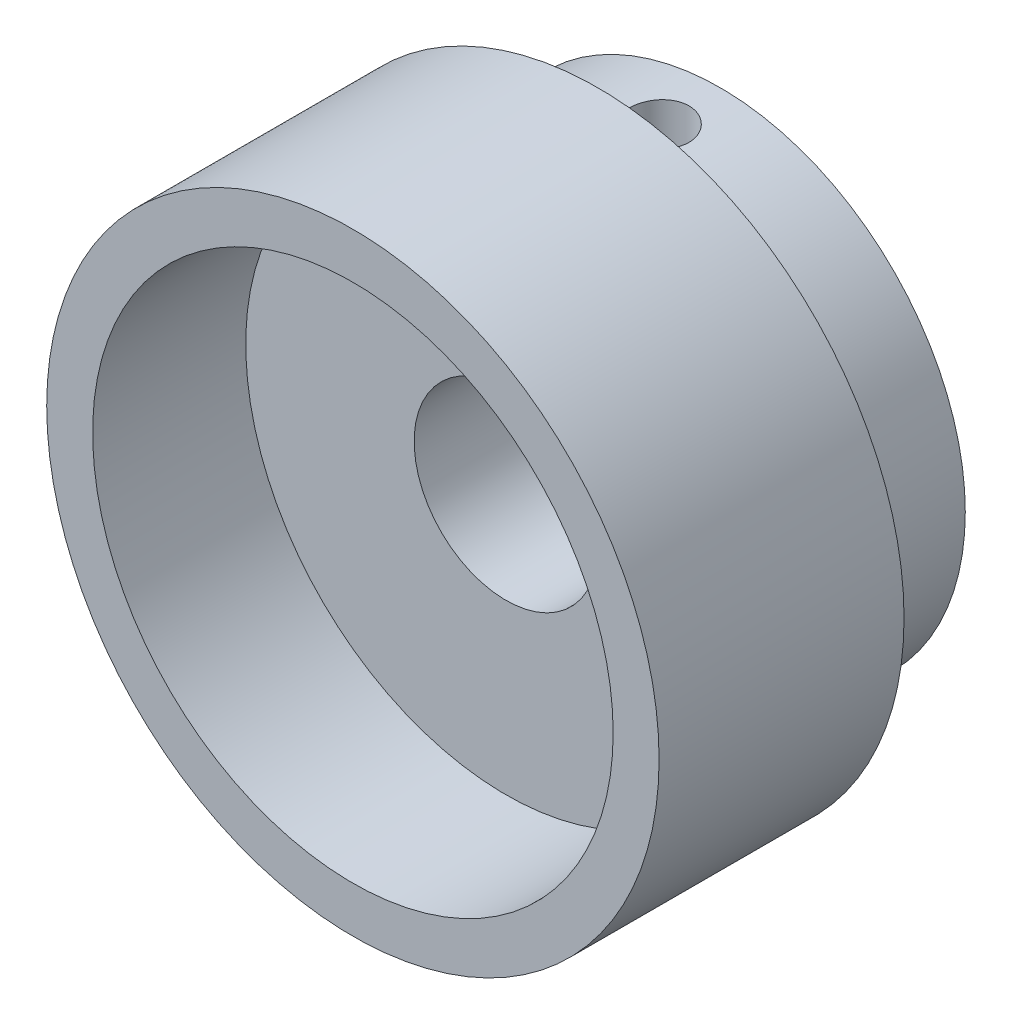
ISO-10303-21;
HEADER;
FILE_DESCRIPTION(('STEP AP214'),'2;1');
FILE_NAME('part.step','',(''),(''),'','','');
FILE_SCHEMA(('AUTOMOTIVE_DESIGN { 1 0 10303 214 1 1 1 1 }'));
ENDSEC;
DATA;
#1=APPLICATION_CONTEXT('core data for automotive mechanical design processes');
#2=APPLICATION_PROTOCOL_DEFINITION('international standard','automotive_design',2000,#1);
#3=PRODUCT_CONTEXT('',#1,'mechanical');
#4=PRODUCT('Part','Part','',(#3));
#5=PRODUCT_RELATED_PRODUCT_CATEGORY('part','',(#4));
#6=PRODUCT_DEFINITION_FORMATION('','',#4);
#7=PRODUCT_DEFINITION_CONTEXT('part definition',#1,'design');
#8=PRODUCT_DEFINITION('design','',#6,#7);
#9=PRODUCT_DEFINITION_SHAPE('','',#8);
#10=(LENGTH_UNIT() NAMED_UNIT(*) SI_UNIT(.MILLI.,.METRE.));
#11=(NAMED_UNIT(*) PLANE_ANGLE_UNIT() SI_UNIT($,.RADIAN.));
#12=(NAMED_UNIT(*) SI_UNIT($,.STERADIAN.) SOLID_ANGLE_UNIT());
#13=UNCERTAINTY_MEASURE_WITH_UNIT(LENGTH_MEASURE(1.E-05),#10,'distance_accuracy_value','');
#14=(GEOMETRIC_REPRESENTATION_CONTEXT(3) GLOBAL_UNCERTAINTY_ASSIGNED_CONTEXT((#13)) GLOBAL_UNIT_ASSIGNED_CONTEXT((#10,
#11,#12)) REPRESENTATION_CONTEXT('',''));
#15=CARTESIAN_POINT('',(0.,0.,0.));
#16=DIRECTION('',(0.,0.,1.));
#17=DIRECTION('',(1.,0.,0.));
#18=AXIS2_PLACEMENT_3D('',#15,#16,#17);
#19=CARTESIAN_POINT('',(0.,0.,20.));
#20=DIRECTION('',(0.,0.,1.));
#21=DIRECTION('',(1.,0.,0.));
#22=AXIS2_PLACEMENT_3D('',#19,#20,#21);
#23=CYLINDRICAL_SURFACE('',#22,6.);
#24=CARTESIAN_POINT('',(0.,0.,0.));
#25=DIRECTION('',(0.,0.,1.));
#26=DIRECTION('',(1.,0.,0.));
#27=AXIS2_PLACEMENT_3D('',#24,#25,#26);
#28=CIRCLE('',#27,6.);
#29=CARTESIAN_POINT('',(6.,0.,0.));
#30=VERTEX_POINT('',#29);
#31=EDGE_CURVE('E8',#30,#30,#28,.T.);
#32=ORIENTED_EDGE('',*,*,#31,.F.);
#33=EDGE_LOOP('',(#32));
#34=FACE_BOUND('',#33,.T.);
#35=CARTESIAN_POINT('',(0.,0.,14.));
#36=DIRECTION('',(0.,0.,1.));
#37=DIRECTION('',(1.,0.,0.));
#38=AXIS2_PLACEMENT_3D('',#35,#36,#37);
#39=CIRCLE('',#38,6.);
#40=CARTESIAN_POINT('',(6.,0.,14.));
#41=VERTEX_POINT('',#40);
#42=EDGE_CURVE('E25',#41,#41,#39,.T.);
#43=ORIENTED_EDGE('',*,*,#42,.T.);
#44=EDGE_LOOP('',(#43));
#45=FACE_BOUND('',#44,.T.);
#46=CARTESIAN_POINT('',(0.,6.,2.05));
#47=CARTESIAN_POINT('',(-0.10654762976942,5.99999993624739,2.05000001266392));
#48=CARTESIAN_POINT('',(-0.213096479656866,5.99713547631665,2.05876117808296));
#49=CARTESIAN_POINT('',(-0.423064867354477,5.98599010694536,2.09347340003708));
#50=CARTESIAN_POINT('',(-0.526483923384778,5.97770836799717,2.1194270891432));
#51=CARTESIAN_POINT('',(-0.72713509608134,5.95663029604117,2.18754713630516));
#52=CARTESIAN_POINT('',(-0.824376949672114,5.94384128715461,2.22968720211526));
#53=CARTESIAN_POINT('',(-1.0104135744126,5.91506016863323,2.32886779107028));
#54=CARTESIAN_POINT('',(-1.09920680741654,5.89906747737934,2.38591102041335));
#55=CARTESIAN_POINT('',(-1.26876648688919,5.86497559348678,2.51526463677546));
#56=CARTESIAN_POINT('',(-1.34921422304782,5.84682777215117,2.58797991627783));
#57=CARTESIAN_POINT('',(-1.49701406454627,5.81074421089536,2.74575217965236));
#58=CARTESIAN_POINT('',(-1.56436347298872,5.79280851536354,2.83081169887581));
#59=CARTESIAN_POINT('',(-1.68583680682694,5.75865033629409,3.01368221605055));
#60=CARTESIAN_POINT('',(-1.73955302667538,5.74248742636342,3.11177622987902));
#61=CARTESIAN_POINT('',(-1.8295913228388,5.71444098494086,3.31621594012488));
#62=CARTESIAN_POINT('',(-1.86591840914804,5.70255622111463,3.42255924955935));
#63=CARTESIAN_POINT('',(-1.91896356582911,5.68492237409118,3.63686559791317));
#64=CARTESIAN_POINT('',(-1.93627644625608,5.67898771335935,3.74466569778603));
#65=CARTESIAN_POINT('',(-1.9526607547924,5.67337624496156,3.96179137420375));
#66=CARTESIAN_POINT('',(-1.95173749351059,5.67369761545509,4.07111649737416));
#67=CARTESIAN_POINT('',(-1.93213893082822,5.68039878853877,4.28317904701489));
#68=CARTESIAN_POINT('',(-1.91423155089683,5.68651650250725,4.38599714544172));
#69=CARTESIAN_POINT('',(-1.86242269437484,5.70369344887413,4.58708184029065));
#70=CARTESIAN_POINT('',(-1.8285193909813,5.71475324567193,4.6853479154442));
#71=CARTESIAN_POINT('',(-1.74516242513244,5.7407606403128,4.87631816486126));
#72=CARTESIAN_POINT('',(-1.69547573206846,5.75576587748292,4.96891243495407));
#73=CARTESIAN_POINT('',(-1.58212419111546,5.78794837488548,5.14469555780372));
#74=CARTESIAN_POINT('',(-1.51845546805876,5.80512623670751,5.227881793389));
#75=CARTESIAN_POINT('',(-1.37522643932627,5.84075786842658,5.38681348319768));
#76=CARTESIAN_POINT('',(-1.29503579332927,5.85923271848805,5.46198726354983));
#77=CARTESIAN_POINT('',(-1.12295756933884,5.89463082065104,5.59796503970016));
#78=CARTESIAN_POINT('',(-1.03106897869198,5.91155393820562,5.65876779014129));
#79=CARTESIAN_POINT('',(-0.837035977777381,5.94214524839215,5.76470774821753));
#80=CARTESIAN_POINT('',(-0.734806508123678,5.95578269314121,5.80969865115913));
#81=CARTESIAN_POINT('',(-0.523682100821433,5.9780434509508,5.88167052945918));
#82=CARTESIAN_POINT('',(-0.414789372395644,5.98666841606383,5.90865743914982));
#83=CARTESIAN_POINT('',(-0.198274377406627,5.99766191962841,5.94285838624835));
#84=CARTESIAN_POINT('',(-0.0907864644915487,6.00027491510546,5.95084547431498));
#85=CARTESIAN_POINT('',(0.124010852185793,5.999679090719,5.94901300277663));
#86=CARTESIAN_POINT('',(0.231320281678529,5.99647119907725,5.93919628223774));
#87=CARTESIAN_POINT('',(0.439666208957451,5.98475514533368,5.90265032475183));
#88=CARTESIAN_POINT('',(0.540793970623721,5.97639393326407,5.8763896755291));
#89=CARTESIAN_POINT('',(0.737172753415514,5.95536205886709,5.80828141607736));
#90=CARTESIAN_POINT('',(0.832423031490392,5.9426908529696,5.76643183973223));
#91=CARTESIAN_POINT('',(1.01705433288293,5.91392921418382,5.6671436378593));
#92=CARTESIAN_POINT('',(1.10622311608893,5.89775966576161,5.60933390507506));
#93=CARTESIAN_POINT('',(1.27384890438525,5.86384129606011,5.48020605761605));
#94=CARTESIAN_POINT('',(1.35230277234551,5.84609201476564,5.4088840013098));
#95=CARTESIAN_POINT('',(1.49978458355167,5.81004836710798,5.25111941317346));
#96=CARTESIAN_POINT('',(1.5682610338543,5.79176344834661,5.16415795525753));
#97=CARTESIAN_POINT('',(1.6897096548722,5.75750609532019,4.97958339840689));
#98=CARTESIAN_POINT('',(1.74268186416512,5.74153365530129,4.88197032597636));
#99=CARTESIAN_POINT('',(1.83133479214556,5.71387576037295,4.67892847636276));
#100=CARTESIAN_POINT('',(1.86706477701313,5.70217811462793,4.57352297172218));
#101=CARTESIAN_POINT('',(1.92012057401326,5.68453462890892,4.35772733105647));
#102=CARTESIAN_POINT('',(1.93745414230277,5.67858636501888,4.24733931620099));
#103=CARTESIAN_POINT('',(1.95263912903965,5.67338152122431,4.03051592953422));
#104=CARTESIAN_POINT('',(1.95140148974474,5.6738120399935,3.92415112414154));
#105=CARTESIAN_POINT('',(1.93170368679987,5.68054809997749,3.71322760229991));
#106=CARTESIAN_POINT('',(1.91324445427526,5.68685332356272,3.60866878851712));
#107=CARTESIAN_POINT('',(1.8602584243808,5.70440107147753,3.40610073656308));
#108=CARTESIAN_POINT('',(1.82601260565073,5.71555706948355,3.30800992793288));
#109=CARTESIAN_POINT('',(1.74265033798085,5.74152130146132,3.11888969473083));
#110=CARTESIAN_POINT('',(1.69353069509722,5.75633031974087,3.02786179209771));
#111=CARTESIAN_POINT('',(1.57941527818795,5.78870453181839,2.85132628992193));
#112=CARTESIAN_POINT('',(1.51384134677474,5.80635910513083,2.76620888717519));
#113=CARTESIAN_POINT('',(1.36967230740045,5.84204632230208,2.6078914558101));
#114=CARTESIAN_POINT('',(1.29107360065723,5.86007906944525,2.53469473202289));
#115=CARTESIAN_POINT('',(1.11965252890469,5.89527751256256,2.3996219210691));
#116=CARTESIAN_POINT('',(1.02641699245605,5.91238786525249,2.33825404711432));
#117=CARTESIAN_POINT('',(0.830400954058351,5.94308458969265,2.23213560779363));
#118=CARTESIAN_POINT('',(0.727623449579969,5.95667206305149,2.18737984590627));
#119=CARTESIAN_POINT('',(0.521899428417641,5.97809793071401,2.11820017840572));
#120=CARTESIAN_POINT('',(0.41934480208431,5.98623618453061,2.09270356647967));
#121=CARTESIAN_POINT('',(0.211193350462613,5.99718660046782,2.05860553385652));
#122=CARTESIAN_POINT('',(0.105597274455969,6.00000006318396,2.04999998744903));
#123=CARTESIAN_POINT('',(0.,6.,2.05));
#124=B_SPLINE_CURVE_WITH_KNOTS('',3,(#46,#47,#48,#49,#50,#51,#52,#53,#54,#55,#56,#57,#58,#59,
#60,#61,#62,#63,#64,#65,#66,#67,#68,#69,#70,#71,#72,#73,#74,#75,#76,#77,#78,#79,#80,#81,#82,#83,
#84,#85,#86,#87,#88,#89,#90,#91,#92,#93,#94,#95,#96,#97,#98,#99,#100,#101,#102,#103,#104,#105,
#106,#107,#108,#109,#110,#111,#112,#113,#114,#115,#116,#117,#118,#119,#120,#121,#122,#123),
.UNSPECIFIED.,.T.,.F.,(4,2,2,2,2,2,2,2,2,2,2,2,2,2,2,2,2,2,2,2,2,2,2,2,2,2,2,2,2,2,2,2,2,2,2,2,
2,2,4),(0.,0.319254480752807,0.638557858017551,0.957344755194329,1.27618957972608,
1.60455177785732,1.93298151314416,2.2703084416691,2.60753812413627,2.93388820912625,
3.26014325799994,3.57231670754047,3.88452581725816,4.20157729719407,4.51871676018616,
4.85154507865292,5.18440222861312,5.52026283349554,5.85601267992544,6.17784892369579,
6.49963385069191,6.81264216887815,7.12568997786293,7.446739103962,7.76788202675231,
8.10285626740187,8.43782967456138,8.77184021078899,9.10570986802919,9.42325867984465,
9.74079032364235,10.0528764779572,10.3650296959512,10.6902404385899,11.0155411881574,
11.3526664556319,11.6896861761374,12.0061703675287,12.3225772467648),.UNSPECIFIED.);
#125=CARTESIAN_POINT('',(0.,6.,2.05));
#126=VERTEX_POINT('',#125);
#127=EDGE_CURVE('E49',#126,#126,#124,.T.);
#128=ORIENTED_EDGE('',*,*,#127,.T.);
#129=EDGE_LOOP('',(#128));
#130=FACE_BOUND('',#129,.T.);
#131=ADVANCED_FACE('F12',(#34,#45,#130),#23,.F.);
#132=CARTESIAN_POINT('',(0.,0.,20.));
#133=DIRECTION('',(0.,0.,1.));
#134=DIRECTION('',(1.,0.,0.));
#135=AXIS2_PLACEMENT_3D('',#132,#133,#134);
#136=CYLINDRICAL_SURFACE('',#135,16.);
#137=CARTESIAN_POINT('',(0.,0.,0.));
#138=DIRECTION('',(0.,0.,1.));
#139=DIRECTION('',(1.,0.,0.));
#140=AXIS2_PLACEMENT_3D('',#137,#138,#139);
#141=CIRCLE('',#140,16.);
#142=CARTESIAN_POINT('',(16.,0.,0.));
#143=VERTEX_POINT('',#142);
#144=EDGE_CURVE('E46',#143,#143,#141,.T.);
#145=ORIENTED_EDGE('',*,*,#144,.T.);
#146=EDGE_LOOP('',(#145));
#147=FACE_BOUND('',#146,.T.);
#148=CARTESIAN_POINT('',(0.,0.,8.));
#149=DIRECTION('',(0.,0.,1.));
#150=DIRECTION('',(1.,0.,0.));
#151=AXIS2_PLACEMENT_3D('',#148,#149,#150);
#152=CIRCLE('',#151,16.);
#153=CARTESIAN_POINT('',(16.,0.,8.));
#154=VERTEX_POINT('',#153);
#155=EDGE_CURVE('E43',#154,#154,#152,.T.);
#156=ORIENTED_EDGE('',*,*,#155,.F.);
#157=EDGE_LOOP('',(#156));
#158=FACE_BOUND('',#157,.T.);
#159=CARTESIAN_POINT('',(0.,16.,2.05));
#160=CARTESIAN_POINT('',(-0.109098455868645,15.9999985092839,2.05000464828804));
#161=CARTESIAN_POINT('',(-0.218265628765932,15.9988723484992,2.05918661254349));
#162=CARTESIAN_POINT('',(-0.433563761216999,15.9944881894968,2.09567119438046));
#163=CARTESIAN_POINT('',(-0.539691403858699,15.9912279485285,2.12299287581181));
#164=CARTESIAN_POINT('',(-0.745762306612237,15.9829430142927,2.194941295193));
#165=CARTESIAN_POINT('',(-0.845709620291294,15.9779194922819,2.23955654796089));
#166=CARTESIAN_POINT('',(-1.03667874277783,15.9666671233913,2.34480089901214));
#167=CARTESIAN_POINT('',(-1.12770211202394,15.9604384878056,2.4054271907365));
#168=CARTESIAN_POINT('',(-1.29873629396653,15.9474351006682,2.54131276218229));
#169=CARTESIAN_POINT('',(-1.37869357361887,15.940657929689,2.61663919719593));
#170=CARTESIAN_POINT('',(-1.52486495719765,15.927340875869,2.77964271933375));
#171=CARTESIAN_POINT('',(-1.59107836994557,15.9208010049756,2.86732042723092));
#172=CARTESIAN_POINT('',(-1.70808066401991,15.908675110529,3.05288396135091));
#173=CARTESIAN_POINT('',(-1.75881960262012,15.9030922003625,3.15080149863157));
#174=CARTESIAN_POINT('',(-1.84311372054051,15.893544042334,3.3538469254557));
#175=CARTESIAN_POINT('',(-1.87666952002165,15.8895787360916,3.45897455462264));
#176=CARTESIAN_POINT('',(-1.9254826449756,15.8837377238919,3.67290148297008));
#177=CARTESIAN_POINT('',(-1.94083017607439,15.881851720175,3.78167991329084));
#178=CARTESIAN_POINT('',(-1.95307019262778,15.8803512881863,4.00028357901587));
#179=CARTESIAN_POINT('',(-1.94996338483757,15.8807367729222,4.11010877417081));
#180=CARTESIAN_POINT('',(-1.92545700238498,15.8837263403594,4.32706071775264));
#181=CARTESIAN_POINT('',(-1.90415667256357,15.8863183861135,4.43419886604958));
#182=CARTESIAN_POINT('',(-1.84402267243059,15.8934102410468,4.64336857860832));
#183=CARTESIAN_POINT('',(-1.80518866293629,15.8979100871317,4.74540004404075));
#184=CARTESIAN_POINT('',(-1.71098259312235,15.9083242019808,4.94176911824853));
#185=CARTESIAN_POINT('',(-1.65556728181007,15.9142421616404,5.03608577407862));
#186=CARTESIAN_POINT('',(-1.52980260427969,15.9268228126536,5.21411836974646));
#187=CARTESIAN_POINT('',(-1.45945258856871,15.9334855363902,5.29783384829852));
#188=CARTESIAN_POINT('',(-1.30526487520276,15.9468585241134,5.45286385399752));
#189=CARTESIAN_POINT('',(-1.22134161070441,15.9535688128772,5.52409330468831));
#190=CARTESIAN_POINT('',(-1.04268463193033,15.966239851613,5.65146730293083));
#191=CARTESIAN_POINT('',(-0.947950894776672,15.9722005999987,5.70761181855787));
#192=CARTESIAN_POINT('',(-0.750297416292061,15.9827043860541,5.80322179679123));
#193=CARTESIAN_POINT('',(-0.647375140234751,15.9872469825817,5.84268207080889));
#194=CARTESIAN_POINT('',(-0.436297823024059,15.9943985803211,5.90373660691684));
#195=CARTESIAN_POINT('',(-0.328143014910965,15.9970076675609,5.92533166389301));
#196=CARTESIAN_POINT('',(-0.110406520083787,15.9999871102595,5.94993281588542));
#197=CARTESIAN_POINT('',(-0.000838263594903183,16.0003715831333,5.95305613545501));
#198=CARTESIAN_POINT('',(0.21726011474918,15.9988965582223,5.94093430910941));
#199=CARTESIAN_POINT('',(0.32579025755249,15.9970371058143,5.92568953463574));
#200=CARTESIAN_POINT('',(0.538386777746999,15.9912919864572,5.87736163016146));
#201=CARTESIAN_POINT('',(0.642466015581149,15.987412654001,5.84433425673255));
#202=CARTESIAN_POINT('',(0.843608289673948,15.9780622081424,5.76143655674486));
#203=CARTESIAN_POINT('',(0.940671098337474,15.9725910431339,5.71156568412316));
#204=CARTESIAN_POINT('',(1.125549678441,15.9606319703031,5.59611204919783));
#205=CARTESIAN_POINT('',(1.21331767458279,15.9541391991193,5.53045329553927));
#206=CARTESIAN_POINT('',(1.37662948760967,15.9408788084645,5.3853954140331));
#207=CARTESIAN_POINT('',(1.45217284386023,15.9341111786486,5.30599576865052));
#208=CARTESIAN_POINT('',(1.58930567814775,15.9210204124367,5.13519425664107));
#209=CARTESIAN_POINT('',(1.65081755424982,15.9146998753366,5.04372985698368));
#210=CARTESIAN_POINT('',(1.7576055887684,15.9032612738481,4.85169929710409));
#211=CARTESIAN_POINT('',(1.80288205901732,15.8981431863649,4.75113331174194));
#212=CARTESIAN_POINT('',(1.87578782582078,15.8897065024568,4.54400681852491));
#213=CARTESIAN_POINT('',(1.90346120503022,15.88638341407,4.43746201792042));
#214=CARTESIAN_POINT('',(1.94051736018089,15.8818999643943,4.22119478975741));
#215=CARTESIAN_POINT('',(1.94990094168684,15.8807395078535,4.11147250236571));
#216=CARTESIAN_POINT('',(1.9500968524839,15.8807153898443,3.8927368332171));
#217=CARTESIAN_POINT('',(1.94103109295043,15.8818366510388,3.7837235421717));
#218=CARTESIAN_POINT('',(1.90484347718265,15.8862172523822,3.56878221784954));
#219=CARTESIAN_POINT('',(1.87772161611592,15.8894765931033,3.46285418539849));
#220=CARTESIAN_POINT('',(1.80622921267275,15.8977615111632,3.25710429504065));
#221=CARTESIAN_POINT('',(1.76186423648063,15.9027865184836,3.15728047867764));
#222=CARTESIAN_POINT('',(1.65715699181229,15.914037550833,2.9664749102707));
#223=CARTESIAN_POINT('',(1.59681456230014,15.9202635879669,2.87549324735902));
#224=CARTESIAN_POINT('',(1.46141210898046,15.9332644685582,2.70433111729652));
#225=CARTESIAN_POINT('',(1.38626119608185,15.9400425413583,2.62422279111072));
#226=CARTESIAN_POINT('',(1.2235638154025,15.953355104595,2.47770657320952));
#227=CARTESIAN_POINT('',(1.1360144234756,15.9598895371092,2.41130192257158));
#228=CARTESIAN_POINT('',(0.950643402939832,15.9720045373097,2.29387497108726));
#229=CARTESIAN_POINT('',(0.852785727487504,15.9775815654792,2.24290923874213));
#230=CARTESIAN_POINT('',(0.649888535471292,15.9871172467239,2.15820619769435));
#231=CARTESIAN_POINT('',(0.54485700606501,15.9910776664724,2.12445007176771));
#232=CARTESIAN_POINT('',(0.366062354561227,15.9959736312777,2.08325102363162));
#233=CARTESIAN_POINT('',(0.293428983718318,15.9974762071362,2.07079968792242));
#234=CARTESIAN_POINT('',(0.147207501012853,15.9994898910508,2.05417263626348));
#235=CARTESIAN_POINT('',(0.073619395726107,16.0000010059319,2.04999686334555));
#236=CARTESIAN_POINT('',(0.,16.,2.05));
#237=B_SPLINE_CURVE_WITH_KNOTS('',3,(#159,#160,#161,#162,#163,#164,#165,#166,#167,#168,#169,
#170,#171,#172,#173,#174,#175,#176,#177,#178,#179,#180,#181,#182,#183,#184,#185,#186,#187,#188,
#189,#190,#191,#192,#193,#194,#195,#196,#197,#198,#199,#200,#201,#202,#203,#204,#205,#206,#207,
#208,#209,#210,#211,#212,#213,#214,#215,#216,#217,#218,#219,#220,#221,#222,#223,#224,#225,#226,
#227,#228,#229,#230,#231,#232,#233,#234,#235,#236),.UNSPECIFIED.,.T.,.F.,(4,2,2,2,2,2,2,2,2,2,2,
2,2,2,2,2,2,2,2,2,2,2,2,2,2,2,2,2,2,2,2,2,2,2,2,2,2,2,4),(0.,0.327026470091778,0.65439717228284,
0.981550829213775,1.30864717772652,1.63727435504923,1.96591805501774,2.29561146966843,
2.6252929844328,2.95333431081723,3.28136307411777,3.60761380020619,3.93387083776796,
4.26098642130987,4.58811623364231,4.91739501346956,5.24667449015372,5.57605629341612,
5.90542344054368,6.23269810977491,6.55996616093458,6.88621400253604,7.21247242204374,
7.54033380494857,7.86820753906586,8.19785286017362,8.52749184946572,8.85630205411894,
9.18509777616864,9.51172790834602,9.8383581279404,10.1648829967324,10.4914111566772,
10.8200096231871,11.1486857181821,11.4785519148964,11.8080566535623,12.0287349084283,
12.2494116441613),.UNSPECIFIED.);
#238=CARTESIAN_POINT('',(0.,16.,2.05));
#239=VERTEX_POINT('',#238);
#240=EDGE_CURVE('E16',#239,#239,#237,.T.);
#241=ORIENTED_EDGE('',*,*,#240,.F.);
#242=EDGE_LOOP('',(#241));
#243=FACE_BOUND('',#242,.T.);
#244=ADVANCED_FACE('F61',(#147,#158,#243),#136,.T.);
#245=CARTESIAN_POINT('',(-6.,0.,0.));
#246=DIRECTION('',(0.,0.,1.));
#247=DIRECTION('',(1.,0.,0.));
#248=AXIS2_PLACEMENT_3D('',#245,#246,#247);
#249=PLANE('',#248);
#250=ORIENTED_EDGE('',*,*,#144,.F.);
#251=EDGE_LOOP('',(#250));
#252=FACE_BOUND('',#251,.T.);
#253=ORIENTED_EDGE('',*,*,#31,.T.);
#254=EDGE_LOOP('',(#253));
#255=FACE_BOUND('',#254,.T.);
#256=ADVANCED_FACE('F14',(#252,#255),#249,.F.);
#257=CARTESIAN_POINT('',(-6.,0.,14.));
#258=DIRECTION('',(0.,0.,1.));
#259=DIRECTION('',(1.,0.,0.));
#260=AXIS2_PLACEMENT_3D('',#257,#258,#259);
#261=PLANE('',#260);
#262=CARTESIAN_POINT('',(0.,0.,14.));
#263=DIRECTION('',(0.,0.,1.));
#264=DIRECTION('',(1.,0.,0.));
#265=AXIS2_PLACEMENT_3D('',#262,#263,#264);
#266=CIRCLE('',#265,17.);
#267=CARTESIAN_POINT('',(17.,0.,14.));
#268=VERTEX_POINT('',#267);
#269=EDGE_CURVE('E29',#268,#268,#266,.T.);
#270=ORIENTED_EDGE('',*,*,#269,.T.);
#271=EDGE_LOOP('',(#270));
#272=FACE_BOUND('',#271,.T.);
#273=ORIENTED_EDGE('',*,*,#42,.F.);
#274=EDGE_LOOP('',(#273));
#275=FACE_BOUND('',#274,.T.);
#276=ADVANCED_FACE('F80',(#272,#275),#261,.T.);
#277=CARTESIAN_POINT('',(0.,0.,20.));
#278=DIRECTION('',(0.,0.,1.));
#279=DIRECTION('',(1.,0.,0.));
#280=AXIS2_PLACEMENT_3D('',#277,#278,#279);
#281=CYLINDRICAL_SURFACE('',#280,17.);
#282=CARTESIAN_POINT('',(0.,0.,24.));
#283=DIRECTION('',(0.,0.,1.));
#284=DIRECTION('',(1.,0.,0.));
#285=AXIS2_PLACEMENT_3D('',#282,#283,#284);
#286=CIRCLE('',#285,17.);
#287=CARTESIAN_POINT('',(17.,0.,24.));
#288=VERTEX_POINT('',#287);
#289=EDGE_CURVE('E34',#288,#288,#286,.T.);
#290=ORIENTED_EDGE('',*,*,#289,.T.);
#291=EDGE_LOOP('',(#290));
#292=FACE_BOUND('',#291,.T.);
#293=ORIENTED_EDGE('',*,*,#269,.F.);
#294=EDGE_LOOP('',(#293));
#295=FACE_BOUND('',#294,.T.);
#296=ADVANCED_FACE('F77',(#292,#295),#281,.F.);
#297=CARTESIAN_POINT('',(-17.,0.,24.));
#298=DIRECTION('',(0.,0.,1.));
#299=DIRECTION('',(1.,0.,0.));
#300=AXIS2_PLACEMENT_3D('',#297,#298,#299);
#301=PLANE('',#300);
#302=CARTESIAN_POINT('',(0.,0.,24.));
#303=DIRECTION('',(0.,0.,1.));
#304=DIRECTION('',(1.,0.,0.));
#305=AXIS2_PLACEMENT_3D('',#302,#303,#304);
#306=CIRCLE('',#305,20.);
#307=CARTESIAN_POINT('',(20.,0.,24.));
#308=VERTEX_POINT('',#307);
#309=EDGE_CURVE('E37',#308,#308,#306,.T.);
#310=ORIENTED_EDGE('',*,*,#309,.T.);
#311=EDGE_LOOP('',(#310));
#312=FACE_BOUND('',#311,.T.);
#313=ORIENTED_EDGE('',*,*,#289,.F.);
#314=EDGE_LOOP('',(#313));
#315=FACE_BOUND('',#314,.T.);
#316=ADVANCED_FACE('F73',(#312,#315),#301,.T.);
#317=CARTESIAN_POINT('',(0.,0.,20.));
#318=DIRECTION('',(0.,0.,1.));
#319=DIRECTION('',(1.,0.,0.));
#320=AXIS2_PLACEMENT_3D('',#317,#318,#319);
#321=CYLINDRICAL_SURFACE('',#320,20.);
#322=CARTESIAN_POINT('',(0.,0.,8.));
#323=DIRECTION('',(0.,0.,1.));
#324=DIRECTION('',(1.,0.,0.));
#325=AXIS2_PLACEMENT_3D('',#322,#323,#324);
#326=CIRCLE('',#325,20.);
#327=CARTESIAN_POINT('',(20.,0.,8.));
#328=VERTEX_POINT('',#327);
#329=EDGE_CURVE('E40',#328,#328,#326,.T.);
#330=ORIENTED_EDGE('',*,*,#329,.T.);
#331=EDGE_LOOP('',(#330));
#332=FACE_BOUND('',#331,.T.);
#333=ORIENTED_EDGE('',*,*,#309,.F.);
#334=EDGE_LOOP('',(#333));
#335=FACE_BOUND('',#334,.T.);
#336=ADVANCED_FACE('F69',(#332,#335),#321,.T.);
#337=CARTESIAN_POINT('',(-16.,0.,8.));
#338=DIRECTION('',(0.,0.,1.));
#339=DIRECTION('',(1.,0.,0.));
#340=AXIS2_PLACEMENT_3D('',#337,#338,#339);
#341=PLANE('',#340);
#342=ORIENTED_EDGE('',*,*,#329,.F.);
#343=EDGE_LOOP('',(#342));
#344=FACE_BOUND('',#343,.T.);
#345=ORIENTED_EDGE('',*,*,#155,.T.);
#346=EDGE_LOOP('',(#345));
#347=FACE_BOUND('',#346,.T.);
#348=ADVANCED_FACE('F59',(#344,#347),#341,.F.);
#349=CARTESIAN_POINT('',(0.,20.,4.));
#350=DIRECTION('',(0.,-1.,0.));
#351=DIRECTION('',(0.,0.,-1.));
#352=AXIS2_PLACEMENT_3D('',#349,#350,#351);
#353=CYLINDRICAL_SURFACE('',#352,1.95);
#354=ORIENTED_EDGE('',*,*,#127,.F.);
#355=EDGE_LOOP('',(#354));
#356=FACE_BOUND('',#355,.T.);
#357=ORIENTED_EDGE('',*,*,#240,.T.);
#358=EDGE_LOOP('',(#357));
#359=FACE_BOUND('',#358,.T.);
#360=ADVANCED_FACE('F56',(#356,#359),#353,.F.);
#361=CLOSED_SHELL('',(#131,#244,#256,#276,#296,#316,#336,#348,#360));
#362=MANIFOLD_SOLID_BREP('B1',#361);
#363=ADVANCED_BREP_SHAPE_REPRESENTATION('',(#18,#362),#14);
#364=SHAPE_DEFINITION_REPRESENTATION(#9,#363);
ENDSEC;
END-ISO-10303-21;
